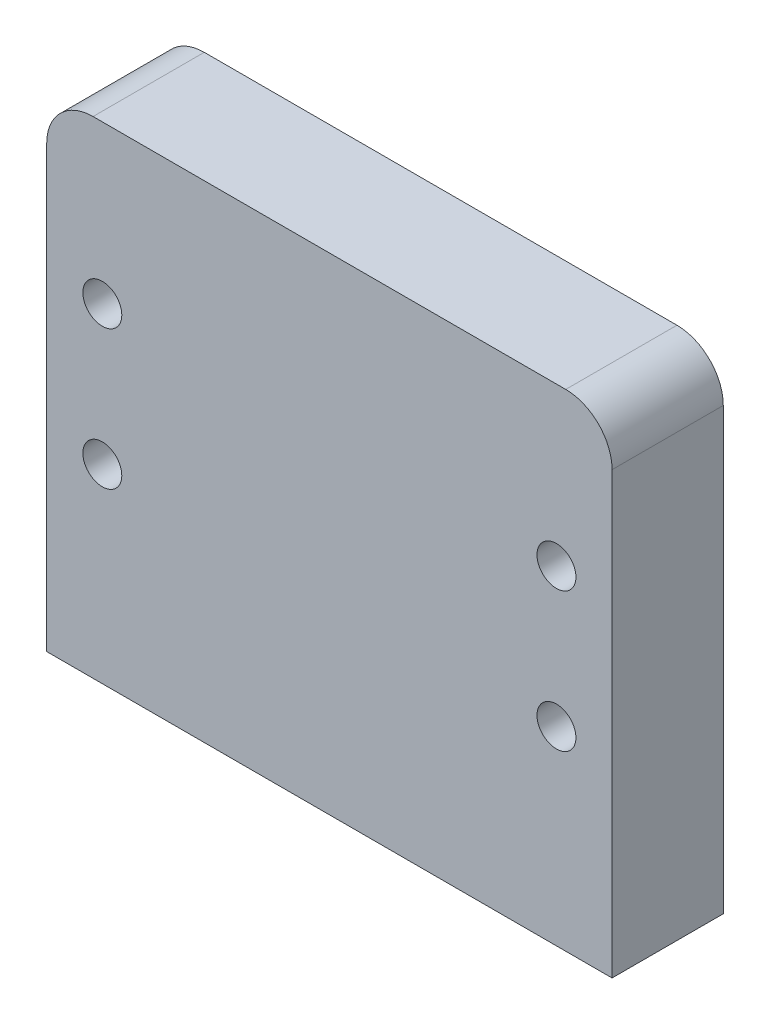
from build123d import *

# Parameters (mm, degrees)
SKIZZE1_W                = 61
SKIZZE1_H                = 52.5
LINEAR_AUSTRAGEN1_DEPTH  = 12
VERRUNDUNG1_R            = 5
M5_GEWINDEBOHRUNG1_D     = 4.2
M5_GEWINDEBOHRUNG1_DEPTH = 14
M5_GEWINDEBOHRUNG1_TIP   = 1.2618073


with BuildPart() as part:
    # Skizze1 → Linear austragen1 (new body)
    with BuildSketch(Plane.XY):
        with Locations((0, 26.25)):
            Rectangle(SKIZZE1_W, SKIZZE1_H)
    extrude(amount=LINEAR_AUSTRAGEN1_DEPTH)

    # Verrundung1
    verrundung1_edges = [part.edges().sort_by_distance(p)[0] for p in [
        (-30.5, 52.5, 6),
        (30.5, 52.5, 6),
    ]]
    fillet(verrundung1_edges, radius=VERRUNDUNG1_R)

    # M5 Gewindebohrung1
    with Locations(Plane(origin=(4.843024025, 20.977202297, 12), x_dir=(-1, 0, 0), z_dir=(0, 0, 1))):
        with Locations((29.343024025, -14.522797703), (29.343024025, 0.477202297), (-19.656975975, 0.477202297), (-19.656975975, -14.522797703)):
            Hole(M5_GEWINDEBOHRUNG1_D / 2, depth=M5_GEWINDEBOHRUNG1_DEPTH)
            with Locations((0, 0, -(M5_GEWINDEBOHRUNG1_DEPTH + M5_GEWINDEBOHRUNG1_TIP / 2))):  # 118° drill point
                Cone(0, M5_GEWINDEBOHRUNG1_D / 2, M5_GEWINDEBOHRUNG1_TIP, mode=Mode.SUBTRACT)


solid = part.part
